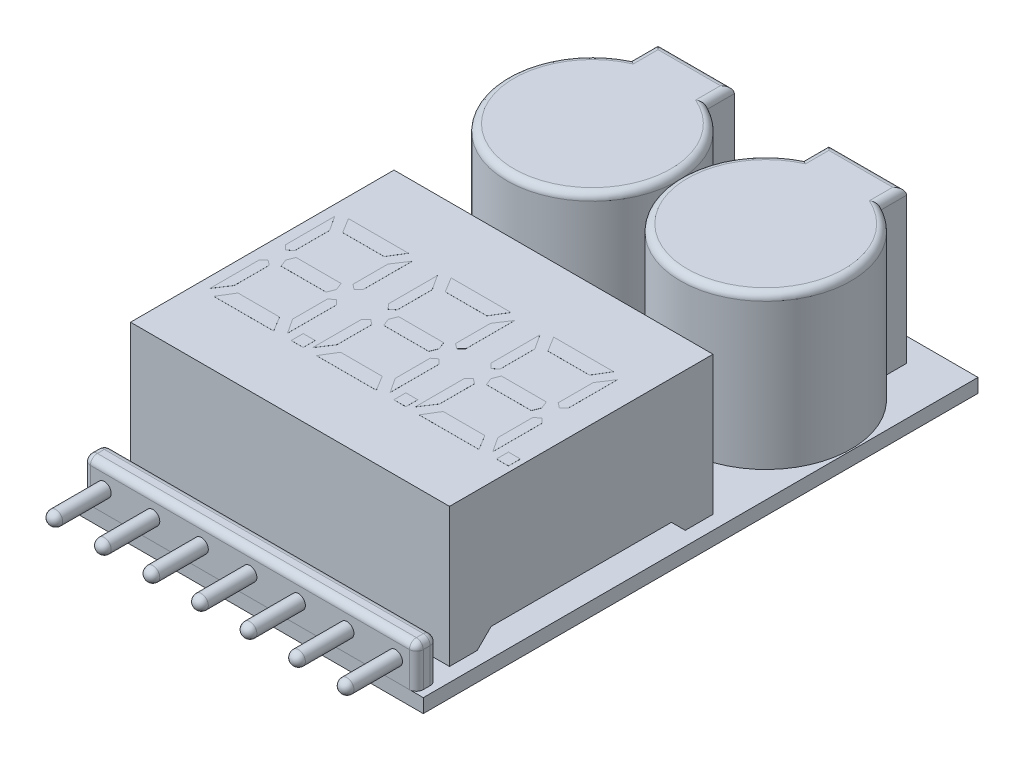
from build123d import *

# Parameters (mm, degrees)
IZIM1_W                         = 25
IZIM1_H                         = 40
Y_KSEKLIK_EKSTR_ZYON1_DEPTH     = 1
IZIM2_W                         = 24
IZIM2_H                         = 1.5
Y_KSEKLIK_EKSTR_ZYON2_DEPTH     = 3
IZIM3_R                         = 0.5
Y_KSEKLIK_EKSTR_ZYON3_DEPTH     = 4
IZIM4_W                         = 23
IZIM4_H                         = 19
Y_KSEKLIK_EKSTR_ZYON4_DEPTH     = 10
Y_KSEKLIK_EKSTR_ZYON10_DEPTH    = 11
KES_EKSTR_ZYON2_DEPTH           = 40
KES_EKSTR_ZYON3_DEPTH           = 20
RADYUS1_R                       = 0.5
RADYUS2_R                       = 0.5
Y_KSEKLIK_EKSTR_ZYON11_DEPTH    = 0.005
Y_KSEKLIK_EKSTR_ZYON11_2_DEPTH  = 0.005
Y_KSEKLIK_EKSTR_ZYON11_3_DEPTH  = 0.005
IZIM8_W                         = 0.864
IZIM8_H                         = 0.864
Y_KSEKLIK_EKSTR_ZYON11_4_DEPTH  = 0.005
Y_KSEKLIK_EKSTR_ZYON11_5_DEPTH  = 0.005
Y_KSEKLIK_EKSTR_ZYON11_6_DEPTH  = 0.005
Y_KSEKLIK_EKSTR_ZYON11_7_DEPTH  = 0.005
Y_KSEKLIK_EKSTR_ZYON11_8_DEPTH  = 0.005
Y_KSEKLIK_EKSTR_ZYON11_9_DEPTH  = 0.005
Y_KSEKLIK_EKSTR_ZYON11_10_DEPTH = 0.005
Y_KSEKLIK_EKSTR_ZYON11_11_DEPTH = 0.005
Y_KSEKLIK_EKSTR_ZYON11_12_DEPTH = 0.005
Y_KSEKLIK_EKSTR_ZYON11_13_DEPTH = 0.005
Y_KSEKLIK_EKSTR_ZYON11_14_DEPTH = 0.005
Y_KSEKLIK_EKSTR_ZYON11_15_DEPTH = 0.005
Y_KSEKLIK_EKSTR_ZYON11_16_DEPTH = 0.005
Y_KSEKLIK_EKSTR_ZYON11_17_DEPTH = 0.005
Y_KSEKLIK_EKSTR_ZYON11_18_DEPTH = 0.005
Y_KSEKLIK_EKSTR_ZYON11_19_DEPTH = 0.005
Y_KSEKLIK_EKSTR_ZYON11_20_DEPTH = 0.005
Y_KSEKLIK_EKSTR_ZYON11_21_DEPTH = 0.005
Y_KSEKLIK_EKSTR_ZYON11_22_DEPTH = 0.005
Y_KSEKLIK_EKSTR_ZYON11_23_DEPTH = 0.005
Y_KSEKLIK_EKSTR_ZYON11_24_DEPTH = 0.005
RADYUS3_R                       = 0.5


with BuildPart() as part:
    # izim1 → Y_kseklik-Ekstr_zyon1 (new body)
    with BuildSketch(Plane(origin=(0, 0, 0), x_dir=(1, 0, 0), z_dir=(0, 1, 0))):
        Rectangle(IZIM1_W, IZIM1_H)
    extrude(amount=Y_KSEKLIK_EKSTR_ZYON1_DEPTH)

    # izim4 → Y_kseklik-Ekstr_zyon4 (add)
    with BuildSketch(Plane(origin=(0, 1, 0), x_dir=(1, 0, 0), z_dir=(0, 1, 0))):
        with Locations((0, -7.609299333)):
            Rectangle(IZIM4_W, IZIM4_H)
    extrude(amount=Y_KSEKLIK_EKSTR_ZYON4_DEPTH)

    # izim5 → Y_kseklik-Ekstr_zyon10 (add)
    with BuildSketch(Plane(origin=(0, 1, 0), x_dir=(1, 0, 0), z_dir=(0, 1, 0))):
        with BuildLine():
            Line((3.448250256, 16.427727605), (3.448250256, 18.297718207))
            Line((3.448250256, 18.297718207), (9.051749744, 18.297718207))
            Line((9.051749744, 18.297718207), (9.051749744, 16.427727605))
            ThreePointArc((9.051749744, 16.427727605), (6.25, 4.788544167), (3.448250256, 16.427727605))
        make_face()
        with BuildLine():
            Line((-9, 16.453867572), (-9, 18.427827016))
            Line((-9, 18.427827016), (-3.5, 18.427827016))
            Line((-3.5, 18.427827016), (-3.5, 16.453867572))
            ThreePointArc((-3.5, 16.453867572), (-6.25, 4.788544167), (-9, 16.453867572))
        make_face()
    extrude(amount=Y_KSEKLIK_EKSTR_ZYON10_DEPTH)

    # izim6 → Kes-Ekstr_zyon2 (cut)
    with BuildSketch(Plane.ZY.offset(11.5)):
        Polygon((15.109299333, 1), (14.109299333, 2), (1.109299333, 2), (0.109299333, 1), align=None)
    extrude(amount=-KES_EKSTR_ZYON2_DEPTH, mode=Mode.SUBTRACT)

    # izim7 → Kes-Ekstr_zyon3 (cut)
    with BuildSketch(Plane.XY.offset(17.109299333)):
        Polygon((-9.5, 1), (-8.385993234, 2), (8.385993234, 2), (9.283653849, 1), align=None)
    extrude(amount=-KES_EKSTR_ZYON3_DEPTH, mode=Mode.SUBTRACT)

    # Radyus2
    radyus2_edges = [part.edges().sort_by_distance(p)[0] for p in [
        (6.25, 12, -4.788544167),
        (9.051749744, 12, -17.362722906),
        (6.25, 12, -18.297718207),
        (3.448250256, 12, -17.362722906),
        (-6.25, 12, -4.788544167),
        (-3.5, 12, -17.440847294),
        (-6.25, 12, -18.427827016),
        (-9, 12, -17.440847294),
    ]]
    fillet(radyus2_edges, radius=RADYUS2_R)


with BuildPart() as body_2:
    # izim2 → Y_kseklik-Ekstr_zyon2 (new body)
    with BuildSketch(Plane(origin=(0, 1, 0), x_dir=(1, 0, 0), z_dir=(0, 1, 0))):
        with Locations((0, -19.25)):
            Rectangle(IZIM2_W, IZIM2_H)
    extrude(amount=Y_KSEKLIK_EKSTR_ZYON2_DEPTH)

    # izim3 → Y_kseklik-Ekstr_zyon3 (add)
    with BuildSketch(Plane.XY.offset(20)):
        with Locations(Location((0, 2.5, 0), (0, 0, 180))):
            Circle(IZIM3_R)
        with Locations(Location((3.5, 2.5, 0), (0, 0, 180))):
            Circle(IZIM3_R)
        with Locations(Location((7, 2.5, 0), (0, 0, 180))):
            Circle(IZIM3_R)
        with Locations(Location((10.5, 2.5, 0), (0, 0, 180))):
            Circle(IZIM3_R)
        with Locations(Location((-3.5, 2.5, 0), (0, 0, 180))):
            Circle(IZIM3_R)
        with Locations(Location((-7, 2.5, 0), (0, 0, 180))):
            Circle(IZIM3_R)
        with Locations(Location((-10.5, 2.5, 0), (0, 0, 180))):
            Circle(IZIM3_R)
    extrude(amount=Y_KSEKLIK_EKSTR_ZYON3_DEPTH)

    # Radyus1
    radyus1_edges = [body_2.edges().sort_by_distance(p)[0] for p in [
        (12, 4, 19.25),
        (0, 4, 18.5),
        (-12, 4, 19.25),
        (0, 4, 20),
        (-12, 2.5, 18.5),
        (12, 2.5, 18.5),
        (12, 2.5, 20),
        (-12, 2.5, 20),
    ]]
    fillet(radyus1_edges, radius=RADYUS1_R)

    # Radyus3
    radyus3_edges = [body_2.edges().sort_by_distance(p)[0] for p in [
        (0.5, 2.5, 24),
        (4, 2.5, 24),
        (7.5, 2.5, 24),
        (11, 2.5, 24),
        (-3, 2.5, 24),
        (-6.5, 2.5, 24),
        (-10, 2.5, 24),
    ]]
    fillet(radyus3_edges, radius=RADYUS3_R)


with BuildPart() as body_3:
    # izim8 → Y_kseklik-Ekstr_zyon11 (new body)
    with BuildSketch(Plane(origin=(0, 11, 0), x_dir=(1, 0, 0), z_dir=(0, 1, 0))):
        Polygon((-9.565923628, -7.102635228), (-6.325923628, -7.102635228), (-6.111966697, -7.642635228), (-6.325923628, -8.182635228), (-9.565923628, -8.182635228), (-9.77988056, -7.642635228), align=None)
    extrude(amount=Y_KSEKLIK_EKSTR_ZYON11_DEPTH)


with BuildPart() as body_4:
    # izim8 → Y_kseklik-Ekstr_zyon11 2 (new body)
    with BuildSketch(Plane(origin=(0, 11, 0), x_dir=(1, 0, 0), z_dir=(0, 1, 0))):
        Polygon((-6.446228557, -11.4174762), (-9.445618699, -11.4174762), (-10.105923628, -12.4974762), (-5.785923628, -12.4974762), align=None)
    extrude(amount=Y_KSEKLIK_EKSTR_ZYON11_2_DEPTH)


with BuildPart() as body_5:
    # izim8 → Y_kseklik-Ekstr_zyon11 3 (new body)
    with BuildSketch(Plane(origin=(0, 11, 0), x_dir=(1, 0, 0), z_dir=(0, 1, 0))):
        Polygon((-10.04799547, -11.079556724), (-10.742963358, -12.137584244), (-10.742963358, -8.607452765), (-10.417746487, -8.274597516), (-10.04799547, -8.558654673), align=None)
    extrude(amount=Y_KSEKLIK_EKSTR_ZYON11_3_DEPTH)


with BuildPart() as body_6:
    # izim8 → Y_kseklik-Ekstr_zyon11 4 (new body)
    with BuildSketch(Plane(origin=(0, 11, 0), x_dir=(1, 0, 0), z_dir=(0, 1, 0))):
        with Locations((-4.127020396, -12.031325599)):
            Rectangle(IZIM8_W, IZIM8_H)
    extrude(amount=Y_KSEKLIK_EKSTR_ZYON11_4_DEPTH)


with BuildPart() as body_7:
    # izim8 → Y_kseklik-Ekstr_zyon11 5 (new body)
    with BuildSketch(Plane(origin=(0, 11, 0), x_dir=(1, 0, 0), z_dir=(0, 1, 0))):
        Polygon((-5.47410077, -8.274597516), (-5.843851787, -8.558654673), (-5.843851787, -11.079556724), (-5.148883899, -12.137584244), (-5.148883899, -8.607452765), align=None)
    extrude(amount=Y_KSEKLIK_EKSTR_ZYON11_5_DEPTH)


with BuildPart() as body_8:
    # izim8 → Y_kseklik-Ekstr_zyon11 6 (new body)
    with BuildSketch(Plane(origin=(0, 11, 0), x_dir=(1, 0, 0), z_dir=(0, 1, 0))):
        Polygon((-2.705923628, -12.4974762), (1.614076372, -12.4974762), (0.953771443, -11.4174762), (-2.045618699, -11.4174762), align=None)
    extrude(amount=Y_KSEKLIK_EKSTR_ZYON11_6_DEPTH)


with BuildPart() as body_9:
    # izim8 → Y_kseklik-Ekstr_zyon11 7 (new body)
    with BuildSketch(Plane(origin=(0, 11, 0), x_dir=(1, 0, 0), z_dir=(0, 1, 0))):
        Polygon((-5.785923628, -2.787794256), (-10.105923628, -2.787794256), (-9.445618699, -3.867794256), (-6.446228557, -3.867794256), align=None)
    extrude(amount=Y_KSEKLIK_EKSTR_ZYON11_7_DEPTH)


with BuildPart() as body_10:
    # izim8 → Y_kseklik-Ekstr_zyon11 8 (new body)
    with BuildSketch(Plane(origin=(0, 11, 0), x_dir=(1, 0, 0), z_dir=(0, 1, 0))):
        Polygon((4.694076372, -12.4974762), (9.014076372, -12.4974762), (8.353771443, -11.4174762), (5.354381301, -11.4174762), align=None)
    extrude(amount=Y_KSEKLIK_EKSTR_ZYON11_8_DEPTH)


with BuildPart() as body_11:
    # izim8 → Y_kseklik-Ekstr_zyon11 9 (new body)
    with BuildSketch(Plane(origin=(0, 11, 0), x_dir=(1, 0, 0), z_dir=(0, 1, 0))):
        Polygon((-5.843851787, -4.205713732), (-5.148883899, -3.147686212), (-5.148883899, -6.677817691), (-5.47410077, -7.01067294), (-5.843851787, -6.726615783), align=None)
    extrude(amount=Y_KSEKLIK_EKSTR_ZYON11_9_DEPTH)


with BuildPart() as body_12:
    # izim8 → Y_kseklik-Ekstr_zyon11 10 (new body)
    with BuildSketch(Plane(origin=(0, 11, 0), x_dir=(1, 0, 0), z_dir=(0, 1, 0))):
        Polygon((5.234076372, -8.182635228), (8.474076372, -8.182635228), (8.688033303, -7.642635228), (8.474076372, -7.102635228), (5.234076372, -7.102635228), (5.02011944, -7.642635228), align=None)
    extrude(amount=Y_KSEKLIK_EKSTR_ZYON11_10_DEPTH)


with BuildPart() as body_13:
    # izim8 → Y_kseklik-Ekstr_zyon11 11 (new body)
    with BuildSketch(Plane(origin=(0, 11, 0), x_dir=(1, 0, 0), z_dir=(0, 1, 0))):
        Polygon((-10.417746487, -7.01067294), (-10.04799547, -6.726615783), (-10.04799547, -4.205713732), (-10.742963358, -3.147686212), (-10.742963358, -6.677817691), align=None)
    extrude(amount=Y_KSEKLIK_EKSTR_ZYON11_11_DEPTH)


with BuildPart() as body_14:
    # izim8 → Y_kseklik-Ekstr_zyon11 12 (new body)
    with BuildSketch(Plane(origin=(0, 11, 0), x_dir=(1, 0, 0), z_dir=(0, 1, 0))):
        Polygon((-2.64799547, -11.079556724), (-3.342963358, -12.137584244), (-3.342963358, -8.607452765), (-3.017746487, -8.274597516), (-2.64799547, -8.558654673), align=None)
    extrude(amount=Y_KSEKLIK_EKSTR_ZYON11_12_DEPTH)


with BuildPart() as body_15:
    # izim8 → Y_kseklik-Ekstr_zyon11 13 (new body)
    with BuildSketch(Plane(origin=(0, 11, 0), x_dir=(1, 0, 0), z_dir=(0, 1, 0))):
        Polygon((1.074076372, -8.182635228), (-2.165923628, -8.182635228), (-2.37988056, -7.642635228), (-2.165923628, -7.102635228), (1.074076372, -7.102635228), (1.288033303, -7.642635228), align=None)
    extrude(amount=Y_KSEKLIK_EKSTR_ZYON11_13_DEPTH)


with BuildPart() as body_16:
    # izim8 → Y_kseklik-Ekstr_zyon11 14 (new body)
    with BuildSketch(Plane(origin=(0, 11, 0), x_dir=(1, 0, 0), z_dir=(0, 1, 0))):
        with Locations((3.272979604, -12.031325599)):
            Rectangle(IZIM8_W, IZIM8_H)
    extrude(amount=Y_KSEKLIK_EKSTR_ZYON11_14_DEPTH)


with BuildPart() as body_17:
    # izim8 → Y_kseklik-Ekstr_zyon11 15 (new body)
    with BuildSketch(Plane(origin=(0, 11, 0), x_dir=(1, 0, 0), z_dir=(0, 1, 0))):
        Polygon((1.92589923, -8.274597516), (1.556148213, -8.558654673), (1.556148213, -11.079556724), (2.251116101, -12.137584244), (2.251116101, -8.607452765), align=None)
    extrude(amount=Y_KSEKLIK_EKSTR_ZYON11_15_DEPTH)


with BuildPart() as body_18:
    # izim8 → Y_kseklik-Ekstr_zyon11 16 (new body)
    with BuildSketch(Plane(origin=(0, 11, 0), x_dir=(1, 0, 0), z_dir=(0, 1, 0))):
        Polygon((1.614076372, -2.787794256), (-2.705923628, -2.787794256), (-2.045618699, -3.867794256), (0.953771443, -3.867794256), align=None)
    extrude(amount=Y_KSEKLIK_EKSTR_ZYON11_16_DEPTH)


with BuildPart() as body_19:
    # izim8 → Y_kseklik-Ekstr_zyon11 17 (new body)
    with BuildSketch(Plane(origin=(0, 11, 0), x_dir=(1, 0, 0), z_dir=(0, 1, 0))):
        Polygon((1.556148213, -4.205713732), (2.251116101, -3.147686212), (2.251116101, -6.677817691), (1.92589923, -7.01067294), (1.556148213, -6.726615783), align=None)
    extrude(amount=Y_KSEKLIK_EKSTR_ZYON11_17_DEPTH)


with BuildPart() as body_20:
    # izim8 → Y_kseklik-Ekstr_zyon11 18 (new body)
    with BuildSketch(Plane(origin=(0, 11, 0), x_dir=(1, 0, 0), z_dir=(0, 1, 0))):
        Polygon((-3.017746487, -7.01067294), (-2.64799547, -6.726615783), (-2.64799547, -4.205713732), (-3.342963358, -3.147686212), (-3.342963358, -6.677817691), align=None)
    extrude(amount=Y_KSEKLIK_EKSTR_ZYON11_18_DEPTH)


with BuildPart() as body_21:
    # izim8 → Y_kseklik-Ekstr_zyon11 19 (new body)
    with BuildSketch(Plane(origin=(0, 11, 0), x_dir=(1, 0, 0), z_dir=(0, 1, 0))):
        Polygon((4.75200453, -11.079556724), (4.057036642, -12.137584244), (4.057036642, -8.607452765), (4.382253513, -8.274597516), (4.75200453, -8.558654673), align=None)
    extrude(amount=Y_KSEKLIK_EKSTR_ZYON11_19_DEPTH)


with BuildPart() as body_22:
    # izim8 → Y_kseklik-Ekstr_zyon11 20 (new body)
    with BuildSketch(Plane(origin=(0, 11, 0), x_dir=(1, 0, 0), z_dir=(0, 1, 0))):
        with Locations((10.672979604, -12.031325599)):
            Rectangle(IZIM8_W, IZIM8_H)
    extrude(amount=Y_KSEKLIK_EKSTR_ZYON11_20_DEPTH)


with BuildPart() as body_23:
    # izim8 → Y_kseklik-Ekstr_zyon11 21 (new body)
    with BuildSketch(Plane(origin=(0, 11, 0), x_dir=(1, 0, 0), z_dir=(0, 1, 0))):
        Polygon((9.32589923, -8.274597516), (8.956148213, -8.558654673), (8.956148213, -11.079556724), (9.651116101, -12.137584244), (9.651116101, -8.607452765), align=None)
    extrude(amount=Y_KSEKLIK_EKSTR_ZYON11_21_DEPTH)


with BuildPart() as body_24:
    # izim8 → Y_kseklik-Ekstr_zyon11 22 (new body)
    with BuildSketch(Plane(origin=(0, 11, 0), x_dir=(1, 0, 0), z_dir=(0, 1, 0))):
        Polygon((9.014076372, -2.787794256), (4.694076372, -2.787794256), (5.354381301, -3.867794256), (8.353771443, -3.867794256), align=None)
    extrude(amount=Y_KSEKLIK_EKSTR_ZYON11_22_DEPTH)


with BuildPart() as body_25:
    # izim8 → Y_kseklik-Ekstr_zyon11 23 (new body)
    with BuildSketch(Plane(origin=(0, 11, 0), x_dir=(1, 0, 0), z_dir=(0, 1, 0))):
        Polygon((8.956148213, -4.205713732), (9.651116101, -3.147686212), (9.651116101, -6.677817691), (9.32589923, -7.01067294), (8.956148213, -6.726615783), align=None)
    extrude(amount=Y_KSEKLIK_EKSTR_ZYON11_23_DEPTH)


with BuildPart() as body_26:
    # izim8 → Y_kseklik-Ekstr_zyon11 24 (new body)
    with BuildSketch(Plane(origin=(0, 11, 0), x_dir=(1, 0, 0), z_dir=(0, 1, 0))):
        Polygon((4.382253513, -7.01067294), (4.75200453, -6.726615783), (4.75200453, -4.205713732), (4.057036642, -3.147686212), (4.057036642, -6.677817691), align=None)
    extrude(amount=Y_KSEKLIK_EKSTR_ZYON11_24_DEPTH)


solid = Compound([part.part, body_2.part, body_3.part, body_4.part, body_5.part, body_6.part, body_7.part, body_8.part, body_9.part, body_10.part, body_11.part, body_12.part, body_13.part, body_14.part, body_15.part, body_16.part, body_17.part, body_18.part, body_19.part, body_20.part, body_21.part, body_22.part, body_23.part, body_24.part, body_25.part, body_26.part])
